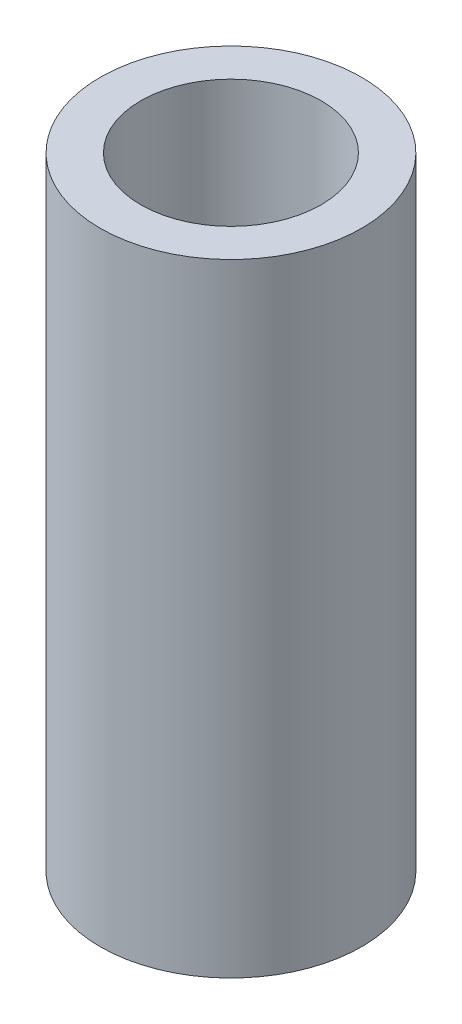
from build123d import *

# Parameters (mm, degrees)
SKIZZE1_R                       = 7.25
SKIZZE1_R_2                     = 5
AUFSATZ_LINEAR_AUSTRAGEN1_DEPTH = 17.25


with BuildPart() as part:
    # Skizze1 → Aufsatz-Linear austragen1 (new, symmetric)
    with BuildSketch(Plane(origin=(0, 0, 0), x_dir=(1, 0, 0), z_dir=(0, 1, 0))):
        with Locations(Location((0, 0, 0), (0, 0, 270))):
            Circle(SKIZZE1_R)
        with Locations(Location((0, 0, 0), (0, 0, 270))):
            Circle(SKIZZE1_R_2, mode=Mode.SUBTRACT)
    extrude(amount=AUFSATZ_LINEAR_AUSTRAGEN1_DEPTH, both=True)


solid = part.part
